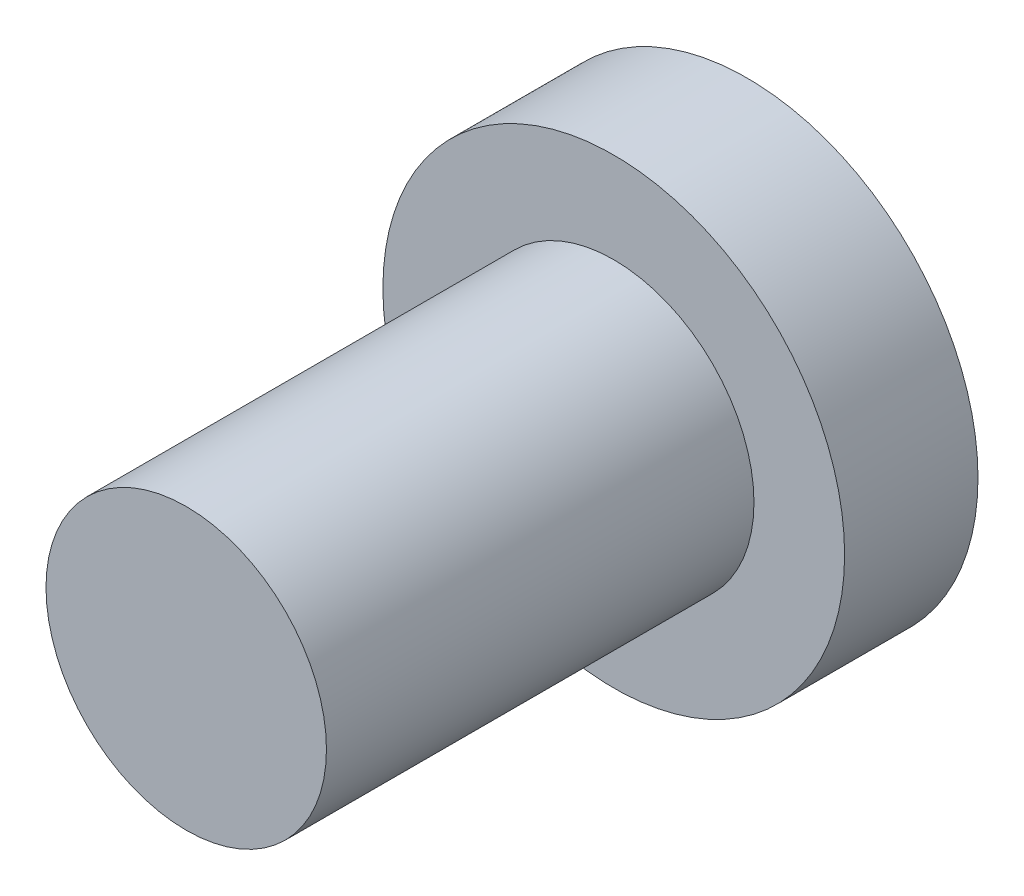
from build123d import *

# Parameters (mm, degrees)
HEX_2_DEPTH = 1.524


with BuildPart() as part:
    # Sketch6 → Revolve1 (revolve)
    with BuildSketch(Plane(origin=(0, 0, 0), x_dir=(0, 0, -1), z_dir=(1, 0, 0)), mode=Mode.PRIVATE) as revolve1_sk:
        Polygon((-6.35, 0), (-6.35, -2.0828), (0, -2.0828), (0, -3.429), (1.9812, -3.429), (1.9812, 0), align=None)
    revolve(revolve1_sk.sketch.rotate(Axis((0, 0, 6.35), (0, 0, -1)), 270), axis=Axis((0, 0, 6.35), (0, 0, -1)))

    # Sketch7 → HEX 2 (cut)
    with BuildSketch(Plane(origin=(0, 0, -1.9812), x_dir=(-1, 0, 0), z_dir=(0, 0, -1))):
        Polygon((-0.9906, 0.571923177), (-0.9906, -0.571923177), (0, -1.143846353), (0.9906, -0.571923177), (0.9906, 0.571923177), (0, 1.143846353), align=None)
    extrude(amount=-HEX_2_DEPTH, mode=Mode.SUBTRACT)


solid = part.part
